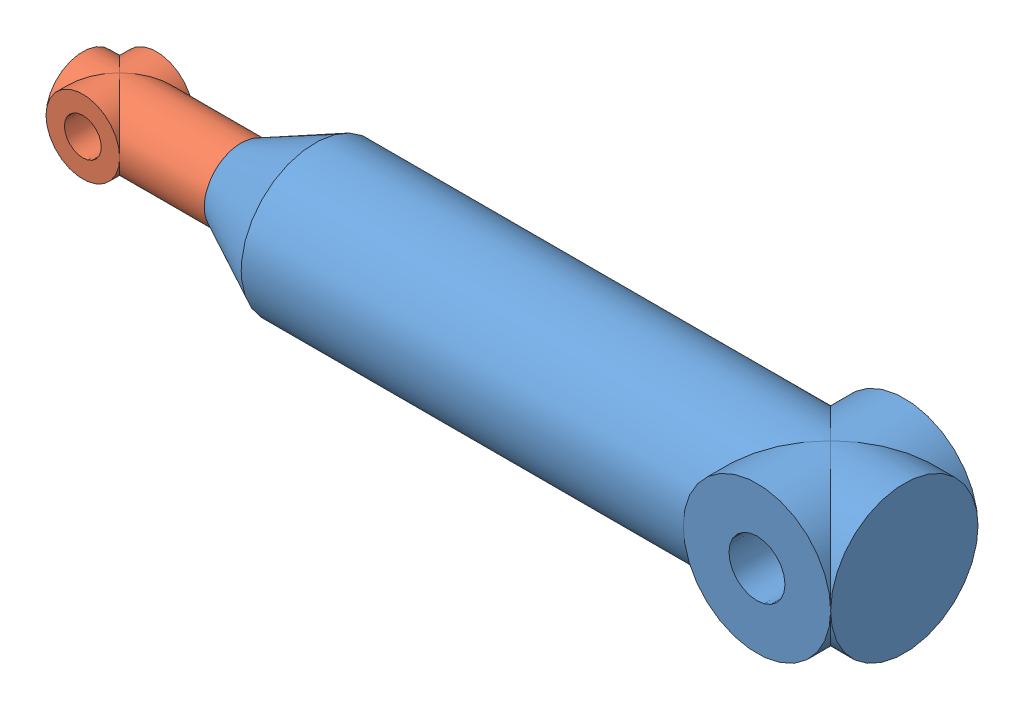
SolidWorks assembly Hydraulic and Brace.SLDASM, configuration Default (file format 6000). Lengths in mm.
Overall size (70.8 12.7 12.7).
2 component instances, 2 part files, 3 mates.
Components (placement in the parent):
- Hydraulic1-1: Hydraulic1.SLDPRT [Default] at (-31.7552 2.7365 -0.181) size (57.15 12.7 12.7)
- BRACE-1: BRACE.SLDPRT [Default] at (-45.4052 2.7365 -0.181) size (38.1 6.35 6.35)
Mates (geometry in assembly coordinates):
- Concentric1: concentric aligned: cylinder of Hydraulic1-1 through (12.6948 2.7365 -0.181) axis (-1 0 0) radius 3.175; cylinder of BRACE-1 through (-45.4052 2.7365 -0.181) axis (-1 0 0) radius 3.175
- Parallel1: parallel aligned: plane of Hydraulic1-1 through (19.0448 2.7365 6.169) normal (0 0 1); plane of BRACE-1 through (-42.2302 2.7365 2.994) normal (0 0 1)
- Distance1: distance = 20 mm anti-aligned: plane of Hydraulic1-1 through (12.6948 2.7365 -0.181) normal (-1 0 0); plane of BRACE-1 through (-7.3052 5.9115 -0.181) normal (1 0 0)
